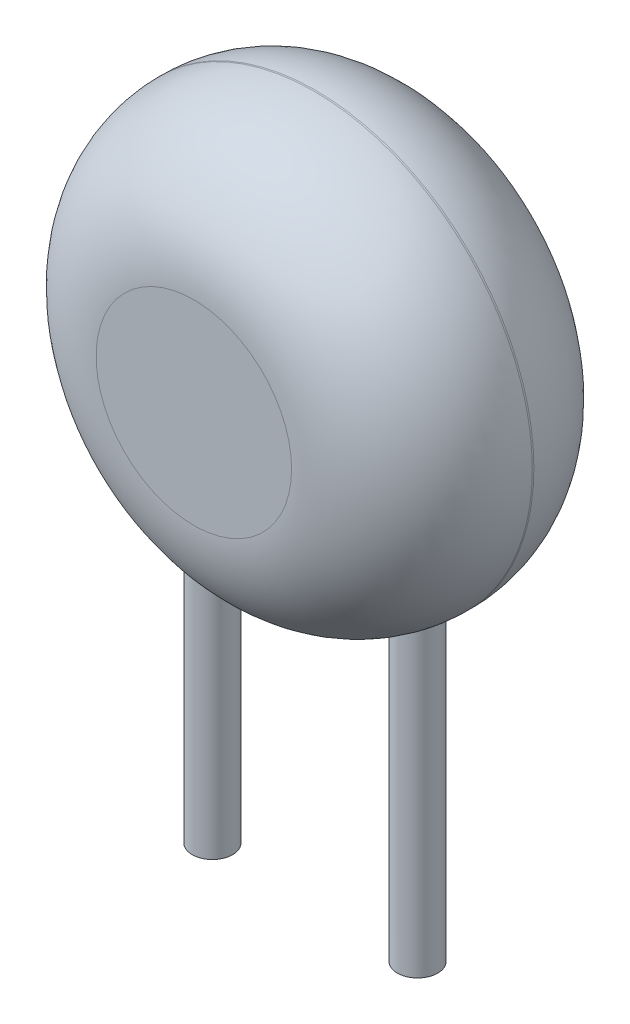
from build123d import *

# Parameters (mm, degrees)
ESQUISSE1_R      = 2.7
EXTRUSION1_DEPTH = 3
CONG_1_R         = 1.49
ESQUISSE2_R      = 0.25
EXTRUSION2_DEPTH = 6


with BuildPart() as part:
    # Esquisse1 → Extrusion1 (new body)
    with BuildSketch(Plane.XY):
        Circle(ESQUISSE1_R)
    extrude(amount=EXTRUSION1_DEPTH)

    # Cong_1
    cong_1_edges = [part.edges().sort_by_distance(p)[0] for p in [
        (-2.7, 0, 0),
        (-2.7, 0, 3),
    ]]
    fillet(cong_1_edges, radius=CONG_1_R)

    # Esquisse2 → Extrusion2 (add)
    with BuildSketch(Plane(origin=(0, 0, 0), x_dir=(-1, 0, 0), z_dir=(0, 1, 0))):
        with Locations(Location((-1.27, 1.5, 0), (0, 0, 90))):
            Circle(ESQUISSE2_R)
        with Locations(Location((1.27, 1.5, 0), (0, 0, 90))):
            Circle(ESQUISSE2_R)
    extrude(amount=-EXTRUSION2_DEPTH)


solid = part.part
